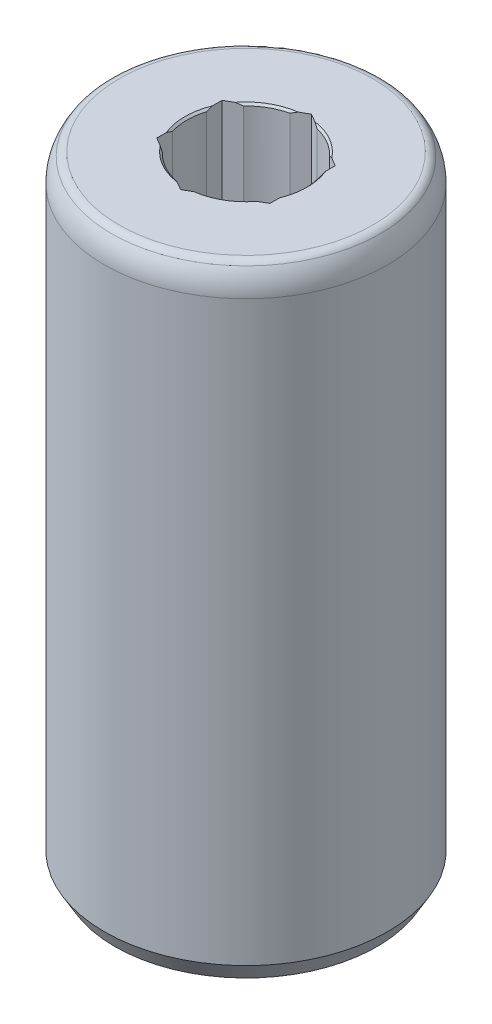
ISO-10303-21;
HEADER;
FILE_DESCRIPTION(('STEP AP214'),'2;1');
FILE_NAME('part.step','',(''),(''),'','','');
FILE_SCHEMA(('AUTOMOTIVE_DESIGN { 1 0 10303 214 1 1 1 1 }'));
ENDSEC;
DATA;
#1=APPLICATION_CONTEXT('core data for automotive mechanical design processes');
#2=APPLICATION_PROTOCOL_DEFINITION('international standard','automotive_design',2000,#1);
#3=PRODUCT_CONTEXT('',#1,'mechanical');
#4=PRODUCT('Part','Part','',(#3));
#5=PRODUCT_RELATED_PRODUCT_CATEGORY('part','',(#4));
#6=PRODUCT_DEFINITION_FORMATION('','',#4);
#7=PRODUCT_DEFINITION_CONTEXT('part definition',#1,'design');
#8=PRODUCT_DEFINITION('design','',#6,#7);
#9=PRODUCT_DEFINITION_SHAPE('','',#8);
#10=(LENGTH_UNIT() NAMED_UNIT(*) SI_UNIT(.MILLI.,.METRE.));
#11=(NAMED_UNIT(*) PLANE_ANGLE_UNIT() SI_UNIT($,.RADIAN.));
#12=(NAMED_UNIT(*) SI_UNIT($,.STERADIAN.) SOLID_ANGLE_UNIT());
#13=UNCERTAINTY_MEASURE_WITH_UNIT(LENGTH_MEASURE(1.E-05),#10,'distance_accuracy_value','');
#14=(GEOMETRIC_REPRESENTATION_CONTEXT(3) GLOBAL_UNCERTAINTY_ASSIGNED_CONTEXT((#13)) GLOBAL_UNIT_ASSIGNED_CONTEXT((#10,
#11,#12)) REPRESENTATION_CONTEXT('',''));
#15=CARTESIAN_POINT('',(0.,0.,0.));
#16=DIRECTION('',(0.,0.,1.));
#17=DIRECTION('',(1.,0.,0.));
#18=AXIS2_PLACEMENT_3D('',#15,#16,#17);
#19=CARTESIAN_POINT('',(0.,-19.05,0.));
#20=DIRECTION('',(0.,-1.,0.));
#21=DIRECTION('',(0.,0.,-1.));
#22=AXIS2_PLACEMENT_3D('',#19,#20,#21);
#23=PLANE('',#22);
#24=CARTESIAN_POINT('',(0.,-19.05,0.));
#25=DIRECTION('',(0.,-1.,0.));
#26=DIRECTION('',(0.,0.,-1.));
#27=AXIS2_PLACEMENT_3D('',#24,#25,#26);
#28=CIRCLE('',#27,2.5527);
#29=CARTESIAN_POINT('',(0.,-19.05,-2.5527));
#30=VERTEX_POINT('',#29);
#31=EDGE_CURVE('E265',#30,#30,#28,.T.);
#32=ORIENTED_EDGE('',*,*,#31,.F.);
#33=EDGE_LOOP('',(#32));
#34=FACE_BOUND('',#33,.T.);
#35=CARTESIAN_POINT('',(0.,-19.05,0.));
#36=DIRECTION('',(0.,-1.,0.));
#37=DIRECTION('',(0.,0.,-1.));
#38=AXIS2_PLACEMENT_3D('',#35,#36,#37);
#39=CIRCLE('',#38,7.35091212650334);
#40=CARTESIAN_POINT('',(0.,-19.05,-7.35091212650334));
#41=VERTEX_POINT('',#40);
#42=EDGE_CURVE('E283',#41,#41,#39,.T.);
#43=ORIENTED_EDGE('',*,*,#42,.T.);
#44=EDGE_LOOP('',(#43));
#45=FACE_BOUND('',#44,.T.);
#46=ADVANCED_FACE('F41',(#34,#45),#23,.T.);
#47=CARTESIAN_POINT('',(0.,-19.05,0.));
#48=DIRECTION('',(0.,1.,0.));
#49=DIRECTION('',(0.,0.,1.));
#50=AXIS2_PLACEMENT_3D('',#47,#48,#49);
#51=CONICAL_SURFACE('',#50,7.35091212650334,0.523598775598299);
#52=CARTESIAN_POINT('',(0.,-18.034,0.));
#53=DIRECTION('',(0.,-1.,0.));
#54=DIRECTION('',(0.,0.,-1.));
#55=AXIS2_PLACEMENT_3D('',#52,#53,#54);
#56=CIRCLE('',#55,7.9375);
#57=CARTESIAN_POINT('',(0.,-18.034,-7.9375));
#58=VERTEX_POINT('',#57);
#59=EDGE_CURVE('E280',#58,#58,#56,.T.);
#60=ORIENTED_EDGE('',*,*,#59,.T.);
#61=EDGE_LOOP('',(#60));
#62=FACE_BOUND('',#61,.T.);
#63=ORIENTED_EDGE('',*,*,#42,.F.);
#64=EDGE_LOOP('',(#63));
#65=FACE_BOUND('',#64,.T.);
#66=ADVANCED_FACE('F456',(#62,#65),#51,.T.);
#67=CARTESIAN_POINT('',(0.,-19.05,0.));
#68=DIRECTION('',(0.,-1.,0.));
#69=DIRECTION('',(0.,0.,-1.));
#70=AXIS2_PLACEMENT_3D('',#67,#68,#69);
#71=CYLINDRICAL_SURFACE('',#70,7.9375);
#72=CARTESIAN_POINT('',(0.,14.351,0.));
#73=DIRECTION('',(0.,-1.,0.));
#74=DIRECTION('',(0.,0.,-1.));
#75=AXIS2_PLACEMENT_3D('',#72,#73,#74);
#76=CIRCLE('',#75,7.9375);
#77=CARTESIAN_POINT('',(0.,14.351,-7.9375));
#78=VERTEX_POINT('',#77);
#79=EDGE_CURVE('E277',#78,#78,#76,.T.);
#80=ORIENTED_EDGE('',*,*,#79,.T.);
#81=EDGE_LOOP('',(#80));
#82=FACE_BOUND('',#81,.T.);
#83=ORIENTED_EDGE('',*,*,#59,.F.);
#84=EDGE_LOOP('',(#83));
#85=FACE_BOUND('',#84,.T.);
#86=ADVANCED_FACE('F461',(#82,#85),#71,.T.);
#87=CARTESIAN_POINT('',(0.,14.351,0.));
#88=DIRECTION('',(0.,-1.,0.));
#89=DIRECTION('',(0.,0.,-1.));
#90=AXIS2_PLACEMENT_3D('',#87,#88,#89);
#91=TOROIDAL_SURFACE('',#90,5.6515,2.286);
#92=CARTESIAN_POINT('',(0.,15.6572857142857,0.));
#93=DIRECTION('',(0.,-1.,0.));
#94=DIRECTION('',(0.,0.,-1.));
#95=AXIS2_PLACEMENT_3D('',#92,#93,#94);
#96=CIRCLE('',#95,7.52751002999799);
#97=CARTESIAN_POINT('',(0.,15.6572857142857,-7.52751002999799));
#98=VERTEX_POINT('',#97);
#99=EDGE_CURVE('E274',#98,#98,#96,.T.);
#100=ORIENTED_EDGE('',*,*,#99,.T.);
#101=EDGE_LOOP('',(#100));
#102=FACE_BOUND('',#101,.T.);
#103=ORIENTED_EDGE('',*,*,#79,.F.);
#104=EDGE_LOOP('',(#103));
#105=FACE_BOUND('',#104,.T.);
#106=ADVANCED_FACE('F490',(#102,#105),#91,.T.);
#107=CARTESIAN_POINT('',(0.,15.367,0.));
#108=DIRECTION('',(0.,-1.,0.));
#109=DIRECTION('',(0.,0.,-1.));
#110=AXIS2_PLACEMENT_3D('',#107,#108,#109);
#111=TOROIDAL_SURFACE('',#110,7.11061891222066,0.507999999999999);
#112=CARTESIAN_POINT('',(0.,15.875,0.));
#113=DIRECTION('',(0.,-1.,0.));
#114=DIRECTION('',(0.,0.,-1.));
#115=AXIS2_PLACEMENT_3D('',#112,#113,#114);
#116=CIRCLE('',#115,7.11061891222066);
#117=CARTESIAN_POINT('',(0.,15.875,-7.11061891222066));
#118=VERTEX_POINT('',#117);
#119=EDGE_CURVE('E271',#118,#118,#116,.T.);
#120=ORIENTED_EDGE('',*,*,#119,.T.);
#121=EDGE_LOOP('',(#120));
#122=FACE_BOUND('',#121,.T.);
#123=ORIENTED_EDGE('',*,*,#99,.F.);
#124=EDGE_LOOP('',(#123));
#125=FACE_BOUND('',#124,.T.);
#126=ADVANCED_FACE('F487',(#122,#125),#111,.T.);
#127=CARTESIAN_POINT('',(7.11061891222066,15.875,0.));
#128=DIRECTION('',(0.,1.,0.));
#129=DIRECTION('',(0.,0.,1.));
#130=AXIS2_PLACEMENT_3D('',#127,#128,#129);
#131=PLANE('',#130);
#132=CARTESIAN_POINT('',(0.,15.875,0.));
#133=DIRECTION('',(0.,-1.,0.));
#134=DIRECTION('',(1.,0.,0.));
#135=AXIS2_PLACEMENT_3D('',#132,#133,#134);
#136=CIRCLE('',#135,3.42900000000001);
#137=CARTESIAN_POINT('',(2.70913363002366,15.875,2.1020551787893));
#138=VERTEX_POINT('',#137);
#139=CARTESIAN_POINT('',(0.465866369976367,15.875,3.39720613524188));
#140=VERTEX_POINT('',#139);
#141=EDGE_CURVE('E61',#138,#140,#136,.T.);
#142=ORIENTED_EDGE('',*,*,#141,.T.);
#143=DIRECTION('',(0.866025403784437,0.,-0.500000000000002));
#144=VECTOR('',#143,1.);
#145=CARTESIAN_POINT('',(0.,15.875,3.66617420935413));
#146=LINE('',#145,#144);
#147=CARTESIAN_POINT('',(0.,15.875,3.66617420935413));
#148=VERTEX_POINT('',#147);
#149=EDGE_CURVE('E241',#148,#140,#146,.T.);
#150=ORIENTED_EDGE('',*,*,#149,.F.);
#151=DIRECTION('',(0.866025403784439,0.,0.499999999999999));
#152=VECTOR('',#151,1.);
#153=CARTESIAN_POINT('',(-3.17499999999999,15.875,1.83308710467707));
#154=LINE('',#153,#152);
#155=CARTESIAN_POINT('',(-0.46586636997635,15.875,3.39720613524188));
#156=VERTEX_POINT('',#155);
#157=EDGE_CURVE('E853',#156,#148,#154,.T.);
#158=ORIENTED_EDGE('',*,*,#157,.F.);
#159=CARTESIAN_POINT('',(-2.70913363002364,15.875,2.10205517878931));
#160=VERTEX_POINT('',#159);
#161=EDGE_CURVE('E856',#156,#160,#136,.T.);
#162=ORIENTED_EDGE('',*,*,#161,.T.);
#163=CARTESIAN_POINT('',(-3.17499999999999,15.875,1.83308710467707));
#164=VERTEX_POINT('',#163);
#165=EDGE_CURVE('E337',#164,#160,#154,.T.);
#166=ORIENTED_EDGE('',*,*,#165,.F.);
#167=DIRECTION('',(0.,0.,1.));
#168=VECTOR('',#167,1.);
#169=CARTESIAN_POINT('',(-3.175,15.875,-1.83308710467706));
#170=LINE('',#169,#168);
#171=CARTESIAN_POINT('',(-3.175,15.875,1.2951509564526));
#172=VERTEX_POINT('',#171);
#173=EDGE_CURVE('E850',#172,#164,#170,.T.);
#174=ORIENTED_EDGE('',*,*,#173,.F.);
#175=CARTESIAN_POINT('',(-3.175,15.875,-1.29515095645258));
#176=VERTEX_POINT('',#175);
#177=EDGE_CURVE('E858',#172,#176,#136,.T.);
#178=ORIENTED_EDGE('',*,*,#177,.T.);
#179=CARTESIAN_POINT('',(-3.175,15.875,-1.83308710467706));
#180=VERTEX_POINT('',#179);
#181=EDGE_CURVE('E851',#180,#176,#170,.T.);
#182=ORIENTED_EDGE('',*,*,#181,.F.);
#183=DIRECTION('',(-0.866025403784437,0.,0.500000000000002));
#184=VECTOR('',#183,1.);
#185=CARTESIAN_POINT('',(0.,15.875,-3.66617420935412));
#186=LINE('',#185,#184);
#187=CARTESIAN_POINT('',(-2.70913363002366,15.875,-2.10205517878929));
#188=VERTEX_POINT('',#187);
#189=EDGE_CURVE('E845',#188,#180,#186,.T.);
#190=ORIENTED_EDGE('',*,*,#189,.F.);
#191=CARTESIAN_POINT('',(-0.465866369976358,15.875,-3.39720613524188));
#192=VERTEX_POINT('',#191);
#193=EDGE_CURVE('E860',#188,#192,#136,.T.);
#194=ORIENTED_EDGE('',*,*,#193,.T.);
#195=CARTESIAN_POINT('',(0.,15.875,-3.66617420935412));
#196=VERTEX_POINT('',#195);
#197=EDGE_CURVE('E847',#196,#192,#186,.T.);
#198=ORIENTED_EDGE('',*,*,#197,.F.);
#199=DIRECTION('',(-0.86602540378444,0.,-0.499999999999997));
#200=VECTOR('',#199,1.);
#201=CARTESIAN_POINT('',(3.175,15.875,-1.83308710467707));
#202=LINE('',#201,#200);
#203=CARTESIAN_POINT('',(0.465866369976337,15.875,-3.39720613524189));
#204=VERTEX_POINT('',#203);
#205=EDGE_CURVE('E846',#204,#196,#202,.T.);
#206=ORIENTED_EDGE('',*,*,#205,.F.);
#207=CARTESIAN_POINT('',(2.70913363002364,15.875,-2.10205517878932));
#208=VERTEX_POINT('',#207);
#209=EDGE_CURVE('E230',#204,#208,#136,.T.);
#210=ORIENTED_EDGE('',*,*,#209,.T.);
#211=CARTESIAN_POINT('',(3.175,15.875,-1.83308710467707));
#212=VERTEX_POINT('',#211);
#213=EDGE_CURVE('E842',#212,#208,#202,.T.);
#214=ORIENTED_EDGE('',*,*,#213,.F.);
#215=DIRECTION('',(0.,0.,-1.));
#216=VECTOR('',#215,1.);
#217=CARTESIAN_POINT('',(3.17500000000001,15.875,1.83308710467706));
#218=LINE('',#217,#216);
#219=CARTESIAN_POINT('',(3.175,15.875,-1.29515095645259));
#220=VERTEX_POINT('',#219);
#221=EDGE_CURVE('E229',#220,#212,#218,.T.);
#222=ORIENTED_EDGE('',*,*,#221,.F.);
#223=CARTESIAN_POINT('',(3.17500000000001,15.875,1.29515095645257));
#224=VERTEX_POINT('',#223);
#225=EDGE_CURVE('E69',#220,#224,#136,.T.);
#226=ORIENTED_EDGE('',*,*,#225,.T.);
#227=CARTESIAN_POINT('',(3.17500000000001,15.875,1.83308710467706));
#228=VERTEX_POINT('',#227);
#229=EDGE_CURVE('E227',#228,#224,#218,.T.);
#230=ORIENTED_EDGE('',*,*,#229,.F.);
#231=EDGE_CURVE('E854',#138,#228,#146,.T.);
#232=ORIENTED_EDGE('',*,*,#231,.F.);
#233=EDGE_LOOP('',(#142,#150,#158,#162,#166,#174,#178,#182,#190,#194,#198,#206,#210,#214,#222,
#226,#230,#232));
#234=FACE_BOUND('',#233,.T.);
#235=ORIENTED_EDGE('',*,*,#119,.F.);
#236=EDGE_LOOP('',(#235));
#237=FACE_BOUND('',#236,.T.);
#238=ADVANCED_FACE('F224',(#234,#237),#131,.T.);
#239=CARTESIAN_POINT('',(0.,-6.858,0.));
#240=DIRECTION('',(0.,-1.,0.));
#241=DIRECTION('',(0.,0.,-1.));
#242=AXIS2_PLACEMENT_3D('',#239,#240,#241);
#243=CONICAL_SURFACE('',#242,2.5527,1.02974425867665);
#244=CARTESIAN_POINT('',(0.,-5.32418309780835,0.));
#245=VERTEX_POINT('',#244);
#246=VERTEX_LOOP('',#245);
#247=FACE_BOUND('',#246,.T.);
#248=CARTESIAN_POINT('',(0.,-6.858,0.));
#249=DIRECTION('',(0.,-1.,0.));
#250=DIRECTION('',(0.,0.,-1.));
#251=AXIS2_PLACEMENT_3D('',#248,#249,#250);
#252=CIRCLE('',#251,2.5527);
#253=CARTESIAN_POINT('',(0.,-6.858,-2.5527));
#254=VERTEX_POINT('',#253);
#255=EDGE_CURVE('E268',#254,#254,#252,.T.);
#256=ORIENTED_EDGE('',*,*,#255,.T.);
#257=EDGE_LOOP('',(#256));
#258=FACE_BOUND('',#257,.T.);
#259=ADVANCED_FACE('F471',(#247,#258),#243,.F.);
#260=CARTESIAN_POINT('',(0.,-19.05,0.));
#261=DIRECTION('',(0.,-1.,0.));
#262=DIRECTION('',(0.,0.,-1.));
#263=AXIS2_PLACEMENT_3D('',#260,#261,#262);
#264=CYLINDRICAL_SURFACE('',#263,2.5527);
#265=ORIENTED_EDGE('',*,*,#255,.F.);
#266=EDGE_LOOP('',(#265));
#267=FACE_BOUND('',#266,.T.);
#268=ORIENTED_EDGE('',*,*,#31,.T.);
#269=EDGE_LOOP('',(#268));
#270=FACE_BOUND('',#269,.T.);
#271=ADVANCED_FACE('F468',(#267,#270),#264,.F.);
#272=CARTESIAN_POINT('',(0.,9.525,0.));
#273=DIRECTION('',(0.,1.,0.));
#274=DIRECTION('',(0.,0.,1.));
#275=AXIS2_PLACEMENT_3D('',#272,#273,#274);
#276=CONICAL_SURFACE('',#275,3.3147,1.02974425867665);
#277=CARTESIAN_POINT('',(0.,7.53332730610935,0.));
#278=VERTEX_POINT('',#277);
#279=VERTEX_LOOP('',#278);
#280=FACE_BOUND('',#279,.T.);
#281=CARTESIAN_POINT('',(0.,9.525,0.));
#282=DIRECTION('',(0.,1.,0.));
#283=DIRECTION('',(0.,0.,1.));
#284=AXIS2_PLACEMENT_3D('',#281,#282,#283);
#285=CIRCLE('',#284,3.3147);
#286=CARTESIAN_POINT('',(0.,9.525,3.3147));
#287=VERTEX_POINT('',#286);
#288=EDGE_CURVE('E248',#287,#287,#285,.T.);
#289=ORIENTED_EDGE('',*,*,#288,.T.);
#290=EDGE_LOOP('',(#289));
#291=FACE_BOUND('',#290,.T.);
#292=ADVANCED_FACE('F470',(#280,#291),#276,.F.);
#293=CARTESIAN_POINT('',(0.,15.875,0.));
#294=DIRECTION('',(0.,1.,0.));
#295=DIRECTION('',(0.,0.,1.));
#296=AXIS2_PLACEMENT_3D('',#293,#294,#295);
#297=CYLINDRICAL_SURFACE('',#296,3.3147);
#298=DIRECTION('',(0.,1.,0.));
#299=VECTOR('',#298,1.);
#300=CARTESIAN_POINT('',(-2.41209585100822,15.875,2.27355002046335));
#301=LINE('',#300,#299);
#302=CARTESIAN_POINT('',(-2.41209585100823,10.287,2.27355002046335));
#303=VERTEX_POINT('',#302);
#304=CARTESIAN_POINT('',(-2.41209585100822,15.7607,2.27355002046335));
#305=VERTEX_POINT('',#304);
#306=EDGE_CURVE('E54',#303,#305,#301,.T.);
#307=ORIENTED_EDGE('',*,*,#306,.T.);
#308=CARTESIAN_POINT('',(0.,15.7607,0.));
#309=DIRECTION('',(0.,1.,0.));
#310=DIRECTION('',(-1.,0.,0.));
#311=AXIS2_PLACEMENT_3D('',#308,#309,#310);
#312=CIRCLE('',#311,3.3147);
#313=CARTESIAN_POINT('',(-0.762904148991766,15.7607,3.22571129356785));
#314=VERTEX_POINT('',#313);
#315=EDGE_CURVE('E326',#305,#314,#312,.T.);
#316=ORIENTED_EDGE('',*,*,#315,.T.);
#317=DIRECTION('',(0.,1.,0.));
#318=VECTOR('',#317,1.);
#319=CARTESIAN_POINT('',(-0.762904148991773,15.875,3.22571129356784));
#320=LINE('',#319,#318);
#321=CARTESIAN_POINT('',(-0.762904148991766,10.287,3.22571129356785));
#322=VERTEX_POINT('',#321);
#323=EDGE_CURVE('E289',#314,#322,#320,.F.);
#324=ORIENTED_EDGE('',*,*,#323,.T.);
#325=CARTESIAN_POINT('',(0.,10.287,0.));
#326=DIRECTION('',(0.,1.,0.));
#327=DIRECTION('',(0.,0.,1.));
#328=AXIS2_PLACEMENT_3D('',#325,#326,#327);
#329=CIRCLE('',#328,3.3147);
#330=CARTESIAN_POINT('',(0.762904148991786,10.287,3.22571129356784));
#331=VERTEX_POINT('',#330);
#332=EDGE_CURVE('E286',#331,#322,#329,.F.);
#333=ORIENTED_EDGE('',*,*,#332,.F.);
#334=DIRECTION('',(0.,1.,0.));
#335=VECTOR('',#334,1.);
#336=CARTESIAN_POINT('',(0.762904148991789,15.875,3.22571129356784));
#337=LINE('',#336,#335);
#338=CARTESIAN_POINT('',(0.762904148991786,15.7607,3.22571129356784));
#339=VERTEX_POINT('',#338);
#340=EDGE_CURVE('E293',#331,#339,#337,.T.);
#341=ORIENTED_EDGE('',*,*,#340,.T.);
#342=CARTESIAN_POINT('',(2.41209585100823,15.7607,2.27355002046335));
#343=VERTEX_POINT('',#342);
#344=EDGE_CURVE('E425',#339,#343,#312,.T.);
#345=ORIENTED_EDGE('',*,*,#344,.T.);
#346=DIRECTION('',(0.,1.,0.));
#347=VECTOR('',#346,1.);
#348=CARTESIAN_POINT('',(2.41209585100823,15.875,2.27355002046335));
#349=LINE('',#348,#347);
#350=CARTESIAN_POINT('',(2.41209585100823,10.287,2.27355002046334));
#351=VERTEX_POINT('',#350);
#352=EDGE_CURVE('E296',#343,#351,#349,.F.);
#353=ORIENTED_EDGE('',*,*,#352,.T.);
#354=CARTESIAN_POINT('',(3.17500000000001,10.287,0.952161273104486));
#355=VERTEX_POINT('',#354);
#356=EDGE_CURVE('E291',#355,#351,#329,.F.);
#357=ORIENTED_EDGE('',*,*,#356,.F.);
#358=DIRECTION('',(0.,1.,0.));
#359=VECTOR('',#358,1.);
#360=CARTESIAN_POINT('',(3.17500000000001,15.875,0.952161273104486));
#361=LINE('',#360,#359);
#362=CARTESIAN_POINT('',(3.17500000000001,15.7607,0.952161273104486));
#363=VERTEX_POINT('',#362);
#364=EDGE_CURVE('E298',#355,#363,#361,.T.);
#365=ORIENTED_EDGE('',*,*,#364,.T.);
#366=CARTESIAN_POINT('',(3.175,15.7607,-0.952161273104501));
#367=VERTEX_POINT('',#366);
#368=EDGE_CURVE('E214',#363,#367,#312,.T.);
#369=ORIENTED_EDGE('',*,*,#368,.T.);
#370=DIRECTION('',(0.,1.,0.));
#371=VECTOR('',#370,1.);
#372=CARTESIAN_POINT('',(3.175,15.875,-0.952161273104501));
#373=LINE('',#372,#371);
#374=CARTESIAN_POINT('',(3.175,10.287,-0.952161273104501));
#375=VERTEX_POINT('',#374);
#376=EDGE_CURVE('E301',#367,#375,#373,.F.);
#377=ORIENTED_EDGE('',*,*,#376,.T.);
#378=CARTESIAN_POINT('',(2.41209585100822,10.287,-2.27355002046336));
#379=VERTEX_POINT('',#378);
#380=EDGE_CURVE('E300',#379,#375,#329,.F.);
#381=ORIENTED_EDGE('',*,*,#380,.F.);
#382=DIRECTION('',(0.,1.,0.));
#383=VECTOR('',#382,1.);
#384=CARTESIAN_POINT('',(2.41209585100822,15.875,-2.27355002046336));
#385=LINE('',#384,#383);
#386=CARTESIAN_POINT('',(2.41209585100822,15.7607,-2.27355002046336));
#387=VERTEX_POINT('',#386);
#388=EDGE_CURVE('E303',#379,#387,#385,.T.);
#389=ORIENTED_EDGE('',*,*,#388,.T.);
#390=CARTESIAN_POINT('',(0.762904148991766,15.7607,-3.22571129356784));
#391=VERTEX_POINT('',#390);
#392=EDGE_CURVE('E874',#387,#391,#312,.T.);
#393=ORIENTED_EDGE('',*,*,#392,.T.);
#394=DIRECTION('',(0.,1.,0.));
#395=VECTOR('',#394,1.);
#396=CARTESIAN_POINT('',(0.762904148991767,15.875,-3.22571129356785));
#397=LINE('',#396,#395);
#398=CARTESIAN_POINT('',(0.762904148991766,10.287,-3.22571129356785));
#399=VERTEX_POINT('',#398);
#400=EDGE_CURVE('E310',#391,#399,#397,.F.);
#401=ORIENTED_EDGE('',*,*,#400,.T.);
#402=CARTESIAN_POINT('',(-0.762904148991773,10.287,-3.22571129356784));
#403=VERTEX_POINT('',#402);
#404=EDGE_CURVE('E306',#403,#399,#329,.F.);
#405=ORIENTED_EDGE('',*,*,#404,.F.);
#406=DIRECTION('',(0.,1.,0.));
#407=VECTOR('',#406,1.);
#408=CARTESIAN_POINT('',(-0.762904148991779,15.875,-3.22571129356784));
#409=LINE('',#408,#407);
#410=CARTESIAN_POINT('',(-0.762904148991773,15.7607,-3.22571129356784));
#411=VERTEX_POINT('',#410);
#412=EDGE_CURVE('E307',#403,#411,#409,.T.);
#413=ORIENTED_EDGE('',*,*,#412,.T.);
#414=CARTESIAN_POINT('',(-2.41209585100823,15.7607,-2.27355002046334));
#415=VERTEX_POINT('',#414);
#416=EDGE_CURVE('E345',#411,#415,#312,.T.);
#417=ORIENTED_EDGE('',*,*,#416,.T.);
#418=DIRECTION('',(0.,1.,0.));
#419=VECTOR('',#418,1.);
#420=CARTESIAN_POINT('',(-2.41209585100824,15.875,-2.27355002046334));
#421=LINE('',#420,#419);
#422=CARTESIAN_POINT('',(-2.41209585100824,10.287,-2.27355002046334));
#423=VERTEX_POINT('',#422);
#424=EDGE_CURVE('E313',#415,#423,#421,.F.);
#425=ORIENTED_EDGE('',*,*,#424,.T.);
#426=CARTESIAN_POINT('',(-3.175,10.287,-0.9521612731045));
#427=VERTEX_POINT('',#426);
#428=EDGE_CURVE('E312',#427,#423,#329,.F.);
#429=ORIENTED_EDGE('',*,*,#428,.F.);
#430=DIRECTION('',(0.,1.,0.));
#431=VECTOR('',#430,1.);
#432=CARTESIAN_POINT('',(-3.175,15.875,-0.9521612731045));
#433=LINE('',#432,#431);
#434=CARTESIAN_POINT('',(-3.175,15.7607,-0.9521612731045));
#435=VERTEX_POINT('',#434);
#436=EDGE_CURVE('E315',#427,#435,#433,.T.);
#437=ORIENTED_EDGE('',*,*,#436,.T.);
#438=CARTESIAN_POINT('',(-3.175,15.7607,0.952161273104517));
#439=VERTEX_POINT('',#438);
#440=EDGE_CURVE('E344',#435,#439,#312,.T.);
#441=ORIENTED_EDGE('',*,*,#440,.T.);
#442=DIRECTION('',(0.,1.,0.));
#443=VECTOR('',#442,1.);
#444=CARTESIAN_POINT('',(-3.175,15.875,0.952161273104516));
#445=LINE('',#444,#443);
#446=CARTESIAN_POINT('',(-3.175,10.287,0.952161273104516));
#447=VERTEX_POINT('',#446);
#448=EDGE_CURVE('E318',#439,#447,#445,.F.);
#449=ORIENTED_EDGE('',*,*,#448,.T.);
#450=EDGE_CURVE('E290',#303,#447,#329,.F.);
#451=ORIENTED_EDGE('',*,*,#450,.F.);
#452=EDGE_LOOP('',(#307,#316,#324,#333,#341,#345,#353,#357,#365,#369,#377,#381,#389,#393,#401,
#405,#413,#417,#425,#429,#437,#441,#449,#451));
#453=FACE_BOUND('',#452,.T.);
#454=ORIENTED_EDGE('',*,*,#288,.F.);
#455=EDGE_LOOP('',(#454));
#456=FACE_BOUND('',#455,.T.);
#457=ADVANCED_FACE('F324',(#453,#456),#297,.F.);
#458=CARTESIAN_POINT('',(0.,10.287,0.));
#459=DIRECTION('',(0.,1.,0.));
#460=DIRECTION('',(0.,0.,1.));
#461=AXIS2_PLACEMENT_3D('',#458,#459,#460);
#462=PLANE('',#461);
#463=ORIENTED_EDGE('',*,*,#332,.T.);
#464=DIRECTION('',(0.866025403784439,0.,0.499999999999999));
#465=VECTOR('',#464,1.);
#466=CARTESIAN_POINT('',(-3.17499999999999,10.287,1.83308710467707));
#467=LINE('',#466,#465);
#468=CARTESIAN_POINT('',(0.,10.287,3.66617420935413));
#469=VERTEX_POINT('',#468);
#470=EDGE_CURVE('E823',#322,#469,#467,.T.);
#471=ORIENTED_EDGE('',*,*,#470,.T.);
#472=DIRECTION('',(0.866025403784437,0.,-0.500000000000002));
#473=VECTOR('',#472,1.);
#474=CARTESIAN_POINT('',(0.,10.287,3.66617420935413));
#475=LINE('',#474,#473);
#476=EDGE_CURVE('E826',#469,#331,#475,.T.);
#477=ORIENTED_EDGE('',*,*,#476,.T.);
#478=EDGE_LOOP('',(#463,#471,#477));
#479=FACE_BOUND('',#478,.T.);
#480=ADVANCED_FACE('F548',(#479),#462,.T.);
#481=CARTESIAN_POINT('',(-3.17499999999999,10.287,1.83308710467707));
#482=DIRECTION('',(-0.499999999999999,0.,0.866025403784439));
#483=DIRECTION('',(0.866025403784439,0.,0.499999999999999));
#484=AXIS2_PLACEMENT_3D('',#481,#482,#483);
#485=PLANE('',#484);
#486=ORIENTED_EDGE('',*,*,#323,.F.);
#487=CARTESIAN_POINT('',(-0.763104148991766,15.760633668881,3.22559582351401));
#488=CARTESIAN_POINT('',(-0.737957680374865,15.7689726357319,3.24011414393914));
#489=CARTESIAN_POINT('',(-0.71289221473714,15.7776349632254,3.25458569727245));
#490=CARTESIAN_POINT('',(-0.662937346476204,15.795571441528,3.28342715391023));
#491=CARTESIAN_POINT('',(-0.63804787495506,15.8048453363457,3.29779709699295));
#492=CARTESIAN_POINT('',(-0.588438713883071,15.8239768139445,3.32643895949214));
#493=CARTESIAN_POINT('',(-0.563719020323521,15.833834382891,3.34071088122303));
#494=CARTESIAN_POINT('',(-0.514440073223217,15.8541072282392,3.36916209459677));
#495=CARTESIAN_POINT('',(-0.489880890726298,15.8645227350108,3.38334134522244));
#496=CARTESIAN_POINT('',(-0.465407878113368,15.8752,3.3974708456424));
#497=B_SPLINE_CURVE_WITH_KNOTS('',3,(#487,#488,#489,#490,#491,#492,#493,#494,#495,#496),
.UNSPECIFIED.,.F.,.F.,(4,2,2,2,4),(0.,0.0906282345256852,0.181218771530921,0.271807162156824,
0.362433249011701),.UNSPECIFIED.);
#498=EDGE_CURVE('E342',#314,#156,#497,.T.);
#499=ORIENTED_EDGE('',*,*,#498,.T.);
#500=ORIENTED_EDGE('',*,*,#157,.T.);
#501=DIRECTION('',(0.,1.,0.));
#502=VECTOR('',#501,1.);
#503=CARTESIAN_POINT('',(0.,10.287,3.66617420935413));
#504=LINE('',#503,#502);
#505=EDGE_CURVE('E250',#469,#148,#504,.T.);
#506=ORIENTED_EDGE('',*,*,#505,.F.);
#507=ORIENTED_EDGE('',*,*,#470,.F.);
#508=EDGE_LOOP('',(#486,#499,#500,#506,#507));
#509=FACE_BOUND('',#508,.T.);
#510=ADVANCED_FACE('F363',(#509),#485,.F.);
#511=CARTESIAN_POINT('',(0.,10.287,3.66617420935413));
#512=DIRECTION('',(0.500000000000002,0.,0.866025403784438));
#513=DIRECTION('',(0.866025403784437,0.,-0.500000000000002));
#514=AXIS2_PLACEMENT_3D('',#511,#512,#513);
#515=PLANE('',#514);
#516=ORIENTED_EDGE('',*,*,#149,.T.);
#517=CARTESIAN_POINT('',(0.465407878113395,15.8752,3.39747084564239));
#518=CARTESIAN_POINT('',(0.48988089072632,15.8645227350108,3.38334134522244));
#519=CARTESIAN_POINT('',(0.514440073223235,15.8541072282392,3.36916209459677));
#520=CARTESIAN_POINT('',(0.563719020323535,15.833834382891,3.34071088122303));
#521=CARTESIAN_POINT('',(0.588438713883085,15.8239768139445,3.32643895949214));
#522=CARTESIAN_POINT('',(0.638047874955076,15.8048453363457,3.29779709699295));
#523=CARTESIAN_POINT('',(0.662937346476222,15.795571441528,3.28342715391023));
#524=CARTESIAN_POINT('',(0.712892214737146,15.7776349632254,3.25458569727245));
#525=CARTESIAN_POINT('',(0.737957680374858,15.7689726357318,3.24011414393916));
#526=CARTESIAN_POINT('',(0.763104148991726,15.7606336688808,3.22559582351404));
#527=B_SPLINE_CURVE_WITH_KNOTS('',3,(#517,#518,#519,#520,#521,#522,#523,#524,#525,#526),
.UNSPECIFIED.,.F.,.F.,(4,2,2,2,4),(0.,0.0906260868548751,0.181214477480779,0.271805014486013,
0.362433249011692),.UNSPECIFIED.);
#528=EDGE_CURVE('E426',#140,#339,#527,.T.);
#529=ORIENTED_EDGE('',*,*,#528,.T.);
#530=ORIENTED_EDGE('',*,*,#340,.F.);
#531=ORIENTED_EDGE('',*,*,#476,.F.);
#532=ORIENTED_EDGE('',*,*,#505,.T.);
#533=EDGE_LOOP('',(#516,#529,#530,#531,#532));
#534=FACE_BOUND('',#533,.T.);
#535=ADVANCED_FACE('F436',(#534),#515,.F.);
#536=ORIENTED_EDGE('',*,*,#356,.T.);
#537=CARTESIAN_POINT('',(3.17500000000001,10.287,1.83308710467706));
#538=VERTEX_POINT('',#537);
#539=EDGE_CURVE('E829',#351,#538,#475,.T.);
#540=ORIENTED_EDGE('',*,*,#539,.T.);
#541=DIRECTION('',(0.,0.,-1.));
#542=VECTOR('',#541,1.);
#543=CARTESIAN_POINT('',(3.17500000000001,10.287,1.83308710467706));
#544=LINE('',#543,#542);
#545=EDGE_CURVE('E262',#538,#355,#544,.T.);
#546=ORIENTED_EDGE('',*,*,#545,.T.);
#547=EDGE_LOOP('',(#536,#540,#546));
#548=FACE_BOUND('',#547,.T.);
#549=ADVANCED_FACE('F434',(#548),#462,.T.);
#550=ORIENTED_EDGE('',*,*,#352,.F.);
#551=CARTESIAN_POINT('',(2.41189585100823,15.760633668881,2.27366549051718));
#552=CARTESIAN_POINT('',(2.43704231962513,15.7689726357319,2.25914717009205));
#553=CARTESIAN_POINT('',(2.46210778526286,15.7776349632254,2.24467561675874));
#554=CARTESIAN_POINT('',(2.51206265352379,15.795571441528,2.21583416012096));
#555=CARTESIAN_POINT('',(2.53695212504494,15.8048453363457,2.20146421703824));
#556=CARTESIAN_POINT('',(2.58656128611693,15.8239768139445,2.17282235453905));
#557=CARTESIAN_POINT('',(2.61128097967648,15.833834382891,2.15855043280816));
#558=CARTESIAN_POINT('',(2.66055992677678,15.8541072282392,2.13009921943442));
#559=CARTESIAN_POINT('',(2.6851191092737,15.8645227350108,2.11591996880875));
#560=CARTESIAN_POINT('',(2.70959212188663,15.8752,2.10179046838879));
#561=B_SPLINE_CURVE_WITH_KNOTS('',3,(#551,#552,#553,#554,#555,#556,#557,#558,#559,#560),
.UNSPECIFIED.,.F.,.F.,(4,2,2,2,4),(0.,0.0906282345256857,0.181218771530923,0.271807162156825,
0.362433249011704),.UNSPECIFIED.);
#562=EDGE_CURVE('E219',#343,#138,#561,.T.);
#563=ORIENTED_EDGE('',*,*,#562,.T.);
#564=ORIENTED_EDGE('',*,*,#231,.T.);
#565=DIRECTION('',(0.,1.,0.));
#566=VECTOR('',#565,1.);
#567=CARTESIAN_POINT('',(3.17500000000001,10.287,1.83308710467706));
#568=LINE('',#567,#566);
#569=EDGE_CURVE('E236',#538,#228,#568,.T.);
#570=ORIENTED_EDGE('',*,*,#569,.F.);
#571=ORIENTED_EDGE('',*,*,#539,.F.);
#572=EDGE_LOOP('',(#550,#563,#564,#570,#571));
#573=FACE_BOUND('',#572,.T.);
#574=ADVANCED_FACE('F431',(#573),#515,.F.);
#575=CARTESIAN_POINT('',(3.17500000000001,10.287,1.83308710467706));
#576=DIRECTION('',(1.,0.,0.));
#577=DIRECTION('',(0.,0.,-1.));
#578=AXIS2_PLACEMENT_3D('',#575,#576,#577);
#579=PLANE('',#578);
#580=ORIENTED_EDGE('',*,*,#229,.T.);
#581=CARTESIAN_POINT('',(3.17500000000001,16.5786223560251,2.64536245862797));
#582=CARTESIAN_POINT('',(3.17500000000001,16.5380732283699,2.58200884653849));
#583=CARTESIAN_POINT('',(3.17500000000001,16.4981275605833,2.51827000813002));
#584=CARTESIAN_POINT('',(3.17500000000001,16.4196314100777,2.38991774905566));
#585=CARTESIAN_POINT('',(3.17500000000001,16.3810812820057,2.32530411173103));
#586=CARTESIAN_POINT('',(3.17500000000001,16.267539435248,2.12952976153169));
#587=CARTESIAN_POINT('',(3.17500000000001,16.1949792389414,1.99693385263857));
#588=CARTESIAN_POINT('',(3.17500000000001,16.0604319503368,1.73097902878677));
#589=CARTESIAN_POINT('',(3.17500000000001,15.9982101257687,1.59773996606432));
#590=CARTESIAN_POINT('',(3.17500000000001,15.8848663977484,1.32675162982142));
#591=CARTESIAN_POINT('',(3.17500000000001,15.8337265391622,1.18901007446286));
#592=CARTESIAN_POINT('',(3.17500000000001,15.7652617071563,0.970766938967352));
#593=CARTESIAN_POINT('',(3.17500000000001,15.7429712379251,0.891817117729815));
#594=CARTESIAN_POINT('',(3.17500000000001,15.7035216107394,0.732644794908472));
#595=CARTESIAN_POINT('',(3.17500000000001,15.6863615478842,0.652422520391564));
#596=CARTESIAN_POINT('',(3.17500000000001,15.6575456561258,0.489771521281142));
#597=CARTESIAN_POINT('',(3.175,15.6459740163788,0.407327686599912));
#598=CARTESIAN_POINT('',(3.175,15.6291088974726,0.241708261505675));
#599=CARTESIAN_POINT('',(3.175,15.6238227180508,0.158531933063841));
#600=CARTESIAN_POINT('',(3.175,15.6218915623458,0.0752476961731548));
#601=B_SPLINE_CURVE_WITH_KNOTS('',3,(#581,#582,#583,#584,#585,#586,#587,#588,#589,#590,#591,
#592,#593,#594,#595,#596,#597,#598,#599,#600),.UNSPECIFIED.,.F.,.F.,(4,2,2,2,2,2,2,2,2,4),(0.,
0.225649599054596,0.451356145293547,0.904548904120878,1.3453581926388,1.78544784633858,
2.0314136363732,2.27733601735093,2.52685580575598,2.776665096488),.UNSPECIFIED.);
#602=EDGE_CURVE('E211',#224,#363,#601,.T.);
#603=ORIENTED_EDGE('',*,*,#602,.T.);
#604=ORIENTED_EDGE('',*,*,#364,.F.);
#605=ORIENTED_EDGE('',*,*,#545,.F.);
#606=ORIENTED_EDGE('',*,*,#569,.T.);
#607=EDGE_LOOP('',(#580,#603,#604,#605,#606));
#608=FACE_BOUND('',#607,.T.);
#609=ADVANCED_FACE('F233',(#608),#579,.F.);
#610=ORIENTED_EDGE('',*,*,#380,.T.);
#611=CARTESIAN_POINT('',(3.175,10.287,-1.83308710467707));
#612=VERTEX_POINT('',#611);
#613=EDGE_CURVE('E828',#375,#612,#544,.T.);
#614=ORIENTED_EDGE('',*,*,#613,.T.);
#615=DIRECTION('',(-0.86602540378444,0.,-0.499999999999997));
#616=VECTOR('',#615,1.);
#617=CARTESIAN_POINT('',(3.175,10.287,-1.83308710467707));
#618=LINE('',#617,#616);
#619=EDGE_CURVE('E239',#612,#379,#618,.T.);
#620=ORIENTED_EDGE('',*,*,#619,.T.);
#621=EDGE_LOOP('',(#610,#614,#620));
#622=FACE_BOUND('',#621,.T.);
#623=ADVANCED_FACE('F442',(#622),#462,.T.);
#624=ORIENTED_EDGE('',*,*,#376,.F.);
#625=CARTESIAN_POINT('',(3.175,15.6210008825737,0.00236734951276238));
#626=CARTESIAN_POINT('',(3.175,15.6209550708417,-0.0512847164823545));
#627=CARTESIAN_POINT('',(3.175,15.6222815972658,-0.104928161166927));
#628=CARTESIAN_POINT('',(3.175,15.6276258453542,-0.212068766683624));
#629=CARTESIAN_POINT('',(3.175,15.6316429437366,-0.265565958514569));
#630=CARTESIAN_POINT('',(3.175,15.6476202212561,-0.425375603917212));
#631=CARTESIAN_POINT('',(3.175,15.6635067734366,-0.531315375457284));
#632=CARTESIAN_POINT('',(3.175,15.7043821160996,-0.739369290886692));
#633=CARTESIAN_POINT('',(3.175,15.7292000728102,-0.841517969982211));
#634=CARTESIAN_POINT('',(3.175,15.7867112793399,-1.04360845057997));
#635=CARTESIAN_POINT('',(3.175,15.8194091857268,-1.14354890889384));
#636=CARTESIAN_POINT('',(3.175,15.9054806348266,-1.37978184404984));
#637=CARTESIAN_POINT('',(3.175,15.9619320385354,-1.5149459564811));
#638=CARTESIAN_POINT('',(3.175,16.0844466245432,-1.78090508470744));
#639=CARTESIAN_POINT('',(3.175,16.1505188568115,-1.91169584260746));
#640=CARTESIAN_POINT('',(3.175,16.2917639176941,-2.17294356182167));
#641=CARTESIAN_POINT('',(3.175,16.3671383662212,-2.30329060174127));
#642=CARTESIAN_POINT('',(3.175,16.4843309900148,-2.49601108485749));
#643=CARTESIAN_POINT('',(3.175,16.5240243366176,-2.55969600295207));
#644=CARTESIAN_POINT('',(3.175,16.6046393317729,-2.68626705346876));
#645=CARTESIAN_POINT('',(3.175,16.645560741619,-2.74915333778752));
#646=CARTESIAN_POINT('',(3.175,16.6870151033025,-2.81168705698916));
#647=B_SPLINE_CURVE_WITH_KNOTS('',3,(#625,#626,#627,#628,#629,#630,#631,#632,#633,#634,#635,
#636,#637,#638,#639,#640,#641,#642,#643,#644,#645,#646),.UNSPECIFIED.,.F.,.F.,(4,2,2,2,2,2,2,2,
2,2,4),(0.,0.160920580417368,0.32180389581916,0.642646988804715,0.957653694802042,
1.27284700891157,1.711754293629,2.15107714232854,2.60258781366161,2.82770394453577,
3.05277659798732),.UNSPECIFIED.);
#648=EDGE_CURVE('E411',#367,#220,#647,.T.);
#649=ORIENTED_EDGE('',*,*,#648,.T.);
#650=ORIENTED_EDGE('',*,*,#221,.T.);
#651=DIRECTION('',(0.,1.,0.));
#652=VECTOR('',#651,1.);
#653=CARTESIAN_POINT('',(3.175,10.287,-1.83308710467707));
#654=LINE('',#653,#652);
#655=EDGE_CURVE('E245',#612,#212,#654,.T.);
#656=ORIENTED_EDGE('',*,*,#655,.F.);
#657=ORIENTED_EDGE('',*,*,#613,.F.);
#658=EDGE_LOOP('',(#624,#649,#650,#656,#657));
#659=FACE_BOUND('',#658,.T.);
#660=ADVANCED_FACE('F437',(#659),#579,.F.);
#661=CARTESIAN_POINT('',(3.175,10.287,-1.83308710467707));
#662=DIRECTION('',(0.499999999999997,0.,-0.86602540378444));
#663=DIRECTION('',(-0.86602540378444,0.,-0.499999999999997));
#664=AXIS2_PLACEMENT_3D('',#661,#662,#663);
#665=PLANE('',#664);
#666=ORIENTED_EDGE('',*,*,#213,.T.);
#667=CARTESIAN_POINT('',(2.70959212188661,15.8752,-2.10179046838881));
#668=CARTESIAN_POINT('',(2.68511910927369,15.8645227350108,-2.11591996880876));
#669=CARTESIAN_POINT('',(2.66055992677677,15.8541072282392,-2.13009921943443));
#670=CARTESIAN_POINT('',(2.61128097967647,15.833834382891,-2.15855043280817));
#671=CARTESIAN_POINT('',(2.58656128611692,15.8239768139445,-2.17282235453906));
#672=CARTESIAN_POINT('',(2.53695212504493,15.8048453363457,-2.20146421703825));
#673=CARTESIAN_POINT('',(2.51206265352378,15.795571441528,-2.21583416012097));
#674=CARTESIAN_POINT('',(2.46210778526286,15.7776349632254,-2.24467561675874));
#675=CARTESIAN_POINT('',(2.43704231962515,15.7689726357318,-2.25914717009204));
#676=CARTESIAN_POINT('',(2.41189585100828,15.7606336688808,-2.27366549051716));
#677=B_SPLINE_CURVE_WITH_KNOTS('',3,(#667,#668,#669,#670,#671,#672,#673,#674,#675,#676),
.UNSPECIFIED.,.F.,.F.,(4,2,2,2,4),(0.,0.090626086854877,0.181214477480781,0.271805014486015,
0.362433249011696),.UNSPECIFIED.);
#678=EDGE_CURVE('E404',#208,#387,#677,.T.);
#679=ORIENTED_EDGE('',*,*,#678,.T.);
#680=ORIENTED_EDGE('',*,*,#388,.F.);
#681=ORIENTED_EDGE('',*,*,#619,.F.);
#682=ORIENTED_EDGE('',*,*,#655,.T.);
#683=EDGE_LOOP('',(#666,#679,#680,#681,#682));
#684=FACE_BOUND('',#683,.T.);
#685=ADVANCED_FACE('F441',(#684),#665,.F.);
#686=ORIENTED_EDGE('',*,*,#404,.T.);
#687=CARTESIAN_POINT('',(0.,10.287,-3.66617420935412));
#688=VERTEX_POINT('',#687);
#689=EDGE_CURVE('E237',#399,#688,#618,.T.);
#690=ORIENTED_EDGE('',*,*,#689,.T.);
#691=DIRECTION('',(-0.866025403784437,0.,0.500000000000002));
#692=VECTOR('',#691,1.);
#693=CARTESIAN_POINT('',(0.,10.287,-3.66617420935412));
#694=LINE('',#693,#692);
#695=EDGE_CURVE('E888',#688,#403,#694,.T.);
#696=ORIENTED_EDGE('',*,*,#695,.T.);
#697=EDGE_LOOP('',(#686,#690,#696));
#698=FACE_BOUND('',#697,.T.);
#699=ADVANCED_FACE('F449',(#698),#462,.T.);
#700=CARTESIAN_POINT('',(0.,10.287,-3.66617420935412));
#701=DIRECTION('',(-0.500000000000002,0.,-0.866025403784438));
#702=DIRECTION('',(-0.866025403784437,0.,0.500000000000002));
#703=AXIS2_PLACEMENT_3D('',#700,#701,#702);
#704=PLANE('',#703);
#705=ORIENTED_EDGE('',*,*,#197,.T.);
#706=CARTESIAN_POINT('',(-0.465407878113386,15.8752,-3.39747084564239));
#707=CARTESIAN_POINT('',(-0.48988089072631,15.8645227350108,-3.38334134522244));
#708=CARTESIAN_POINT('',(-0.514440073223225,15.8541072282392,-3.36916209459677));
#709=CARTESIAN_POINT('',(-0.563719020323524,15.833834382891,-3.34071088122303));
#710=CARTESIAN_POINT('',(-0.588438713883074,15.8239768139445,-3.32643895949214));
#711=CARTESIAN_POINT('',(-0.638047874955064,15.8048453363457,-3.29779709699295));
#712=CARTESIAN_POINT('',(-0.66293734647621,15.795571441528,-3.28342715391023));
#713=CARTESIAN_POINT('',(-0.712892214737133,15.7776349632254,-3.25458569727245));
#714=CARTESIAN_POINT('',(-0.737957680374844,15.7689726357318,-3.24011414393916));
#715=CARTESIAN_POINT('',(-0.763104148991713,15.7606336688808,-3.22559582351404));
#716=B_SPLINE_CURVE_WITH_KNOTS('',3,(#706,#707,#708,#709,#710,#711,#712,#713,#714,#715),
.UNSPECIFIED.,.F.,.F.,(4,2,2,2,4),(0.,0.0906260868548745,0.181214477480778,0.27180501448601,
0.362433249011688),.UNSPECIFIED.);
#717=EDGE_CURVE('E389',#192,#411,#716,.T.);
#718=ORIENTED_EDGE('',*,*,#717,.T.);
#719=ORIENTED_EDGE('',*,*,#412,.F.);
#720=ORIENTED_EDGE('',*,*,#695,.F.);
#721=DIRECTION('',(0.,1.,0.));
#722=VECTOR('',#721,1.);
#723=CARTESIAN_POINT('',(0.,10.287,-3.66617420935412));
#724=LINE('',#723,#722);
#725=EDGE_CURVE('E259',#688,#196,#724,.T.);
#726=ORIENTED_EDGE('',*,*,#725,.T.);
#727=EDGE_LOOP('',(#705,#718,#719,#720,#726));
#728=FACE_BOUND('',#727,.T.);
#729=ADVANCED_FACE('F585',(#728),#704,.F.);
#730=ORIENTED_EDGE('',*,*,#400,.F.);
#731=CARTESIAN_POINT('',(0.763104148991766,15.760633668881,-3.22559582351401));
#732=CARTESIAN_POINT('',(0.737957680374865,15.7689726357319,-3.24011414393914));
#733=CARTESIAN_POINT('',(0.712892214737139,15.7776349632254,-3.25458569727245));
#734=CARTESIAN_POINT('',(0.662937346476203,15.795571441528,-3.28342715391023));
#735=CARTESIAN_POINT('',(0.638047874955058,15.8048453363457,-3.29779709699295));
#736=CARTESIAN_POINT('',(0.588438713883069,15.8239768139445,-3.32643895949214));
#737=CARTESIAN_POINT('',(0.56371902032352,15.833834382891,-3.34071088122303));
#738=CARTESIAN_POINT('',(0.514440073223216,15.8541072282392,-3.36916209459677));
#739=CARTESIAN_POINT('',(0.489880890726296,15.8645227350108,-3.38334134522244));
#740=CARTESIAN_POINT('',(0.465407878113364,15.8752,-3.3974708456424));
#741=B_SPLINE_CURVE_WITH_KNOTS('',3,(#731,#732,#733,#734,#735,#736,#737,#738,#739,#740),
.UNSPECIFIED.,.F.,.F.,(4,2,2,2,4),(0.,0.0906282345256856,0.181218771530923,0.271807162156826,
0.362433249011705),.UNSPECIFIED.);
#742=EDGE_CURVE('E396',#391,#204,#741,.T.);
#743=ORIENTED_EDGE('',*,*,#742,.T.);
#744=ORIENTED_EDGE('',*,*,#205,.T.);
#745=ORIENTED_EDGE('',*,*,#725,.F.);
#746=ORIENTED_EDGE('',*,*,#689,.F.);
#747=EDGE_LOOP('',(#730,#743,#744,#745,#746));
#748=FACE_BOUND('',#747,.T.);
#749=ADVANCED_FACE('F451',(#748),#665,.F.);
#750=ORIENTED_EDGE('',*,*,#428,.T.);
#751=CARTESIAN_POINT('',(-3.175,10.287,-1.83308710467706));
#752=VERTEX_POINT('',#751);
#753=EDGE_CURVE('E886',#423,#752,#694,.T.);
#754=ORIENTED_EDGE('',*,*,#753,.T.);
#755=DIRECTION('',(0.,0.,1.));
#756=VECTOR('',#755,1.);
#757=CARTESIAN_POINT('',(-3.175,10.287,-1.83308710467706));
#758=LINE('',#757,#756);
#759=EDGE_CURVE('E885',#752,#427,#758,.T.);
#760=ORIENTED_EDGE('',*,*,#759,.T.);
#761=EDGE_LOOP('',(#750,#754,#760));
#762=FACE_BOUND('',#761,.T.);
#763=ADVANCED_FACE('F587',(#762),#462,.T.);
#764=ORIENTED_EDGE('',*,*,#424,.F.);
#765=CARTESIAN_POINT('',(-2.41189585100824,15.760633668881,-2.27366549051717));
#766=CARTESIAN_POINT('',(-2.43704231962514,15.7689726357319,-2.25914717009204));
#767=CARTESIAN_POINT('',(-2.46210778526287,15.7776349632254,-2.24467561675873));
#768=CARTESIAN_POINT('',(-2.5120626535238,15.795571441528,-2.21583416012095));
#769=CARTESIAN_POINT('',(-2.53695212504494,15.8048453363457,-2.20146421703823));
#770=CARTESIAN_POINT('',(-2.58656128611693,15.8239768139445,-2.17282235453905));
#771=CARTESIAN_POINT('',(-2.61128097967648,15.833834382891,-2.15855043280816));
#772=CARTESIAN_POINT('',(-2.66055992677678,15.8541072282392,-2.13009921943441));
#773=CARTESIAN_POINT('',(-2.6851191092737,15.8645227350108,-2.11591996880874));
#774=CARTESIAN_POINT('',(-2.70959212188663,15.8752,-2.10179046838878));
#775=B_SPLINE_CURVE_WITH_KNOTS('',3,(#765,#766,#767,#768,#769,#770,#771,#772,#773,#774),
.UNSPECIFIED.,.F.,.F.,(4,2,2,2,4),(0.,0.0906282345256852,0.181218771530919,0.27180716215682,
0.362433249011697),.UNSPECIFIED.);
#776=EDGE_CURVE('E381',#415,#188,#775,.T.);
#777=ORIENTED_EDGE('',*,*,#776,.T.);
#778=ORIENTED_EDGE('',*,*,#189,.T.);
#779=DIRECTION('',(0.,1.,0.));
#780=VECTOR('',#779,1.);
#781=CARTESIAN_POINT('',(-3.175,10.287,-1.83308710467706));
#782=LINE('',#781,#780);
#783=EDGE_CURVE('E256',#752,#180,#782,.T.);
#784=ORIENTED_EDGE('',*,*,#783,.F.);
#785=ORIENTED_EDGE('',*,*,#753,.F.);
#786=EDGE_LOOP('',(#764,#777,#778,#784,#785));
#787=FACE_BOUND('',#786,.T.);
#788=ADVANCED_FACE('F598',(#787),#704,.F.);
#789=CARTESIAN_POINT('',(-3.175,10.287,-1.83308710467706));
#790=DIRECTION('',(-1.,0.,0.));
#791=DIRECTION('',(0.,0.,1.));
#792=AXIS2_PLACEMENT_3D('',#789,#790,#791);
#793=PLANE('',#792);
#794=ORIENTED_EDGE('',*,*,#181,.T.);
#795=CARTESIAN_POINT('',(-3.17500000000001,16.6870151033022,-2.81168705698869));
#796=CARTESIAN_POINT('',(-3.17500000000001,16.6455607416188,-2.74915333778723));
#797=CARTESIAN_POINT('',(-3.17500000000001,16.6046393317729,-2.68626705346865));
#798=CARTESIAN_POINT('',(-3.17500000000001,16.5240243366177,-2.55969600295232));
#799=CARTESIAN_POINT('',(-3.17500000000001,16.4843309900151,-2.49601108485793));
#800=CARTESIAN_POINT('',(-3.175,16.3671383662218,-2.30329060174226));
#801=CARTESIAN_POINT('',(-3.175,16.2917639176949,-2.17294356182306));
#802=CARTESIAN_POINT('',(-3.175,16.1505188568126,-1.91169584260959));
#803=CARTESIAN_POINT('',(-3.175,16.0844466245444,-1.78090508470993));
#804=CARTESIAN_POINT('',(-3.175,15.9619320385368,-1.51494595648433));
#805=CARTESIAN_POINT('',(-3.175,15.905480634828,-1.37978184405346));
#806=CARTESIAN_POINT('',(-3.175,15.8194091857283,-1.14354890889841));
#807=CARTESIAN_POINT('',(-3.175,15.7867112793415,-1.0436084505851));
#808=CARTESIAN_POINT('',(-3.175,15.7292000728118,-0.84151796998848));
#809=CARTESIAN_POINT('',(-3.175,15.7043821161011,-0.739369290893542));
#810=CARTESIAN_POINT('',(-3.175,15.6635067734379,-0.531315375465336));
#811=CARTESIAN_POINT('',(-3.175,15.6476202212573,-0.425375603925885));
#812=CARTESIAN_POINT('',(-3.175,15.6316429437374,-0.265565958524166));
#813=CARTESIAN_POINT('',(-3.175,15.6276258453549,-0.212068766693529));
#814=CARTESIAN_POINT('',(-3.175,15.6222815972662,-0.10492816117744));
#815=CARTESIAN_POINT('',(-3.175,15.6209550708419,-0.0512847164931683));
#816=CARTESIAN_POINT('',(-3.175,15.6210008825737,0.00236734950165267));
#817=B_SPLINE_CURVE_WITH_KNOTS('',3,(#795,#796,#797,#798,#799,#800,#801,#802,#803,#804,#805,
#806,#807,#808,#809,#810,#811,#812,#813,#814,#815,#816),.UNSPECIFIED.,.F.,.F.,(4,2,2,2,2,2,2,2,
2,2,4),(0.,0.225072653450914,0.450188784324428,0.9016994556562,1.34102230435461,
1.77992958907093,2.0951229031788,2.41012960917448,2.73097270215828,2.89185601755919,
3.05277659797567),.UNSPECIFIED.);
#818=EDGE_CURVE('E340',#176,#435,#817,.T.);
#819=ORIENTED_EDGE('',*,*,#818,.T.);
#820=ORIENTED_EDGE('',*,*,#436,.F.);
#821=ORIENTED_EDGE('',*,*,#759,.F.);
#822=ORIENTED_EDGE('',*,*,#783,.T.);
#823=EDGE_LOOP('',(#794,#819,#820,#821,#822));
#824=FACE_BOUND('',#823,.T.);
#825=ADVANCED_FACE('F686',(#824),#793,.F.);
#826=ORIENTED_EDGE('',*,*,#165,.T.);
#827=CARTESIAN_POINT('',(-2.70959212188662,15.8752,2.1017904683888));
#828=CARTESIAN_POINT('',(-2.68511910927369,15.8645227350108,2.11591996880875));
#829=CARTESIAN_POINT('',(-2.66055992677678,15.8541072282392,2.13009921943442));
#830=CARTESIAN_POINT('',(-2.61128097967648,15.833834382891,2.15855043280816));
#831=CARTESIAN_POINT('',(-2.58656128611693,15.8239768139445,2.17282235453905));
#832=CARTESIAN_POINT('',(-2.53695212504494,15.8048453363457,2.20146421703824));
#833=CARTESIAN_POINT('',(-2.51206265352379,15.795571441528,2.21583416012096));
#834=CARTESIAN_POINT('',(-2.46210778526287,15.7776349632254,2.24467561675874));
#835=CARTESIAN_POINT('',(-2.43704231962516,15.7689726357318,2.25914717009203));
#836=CARTESIAN_POINT('',(-2.41189585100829,15.7606336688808,2.27366549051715));
#837=B_SPLINE_CURVE_WITH_KNOTS('',3,(#827,#828,#829,#830,#831,#832,#833,#834,#835,#836),
.UNSPECIFIED.,.F.,.F.,(4,2,2,2,4),(0.,0.0906260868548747,0.181214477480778,0.27180501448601,
0.362433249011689),.UNSPECIFIED.);
#838=EDGE_CURVE('E335',#160,#305,#837,.T.);
#839=ORIENTED_EDGE('',*,*,#838,.T.);
#840=ORIENTED_EDGE('',*,*,#306,.F.);
#841=CARTESIAN_POINT('',(-3.17499999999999,10.287,1.83308710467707));
#842=VERTEX_POINT('',#841);
#843=EDGE_CURVE('E334',#842,#303,#467,.T.);
#844=ORIENTED_EDGE('',*,*,#843,.F.);
#845=DIRECTION('',(0.,1.,0.));
#846=VECTOR('',#845,1.);
#847=CARTESIAN_POINT('',(-3.17499999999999,10.287,1.83308710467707));
#848=LINE('',#847,#846);
#849=EDGE_CURVE('E253',#842,#164,#848,.T.);
#850=ORIENTED_EDGE('',*,*,#849,.T.);
#851=EDGE_LOOP('',(#826,#839,#840,#844,#850));
#852=FACE_BOUND('',#851,.T.);
#853=ADVANCED_FACE('F333',(#852),#485,.F.);
#854=ORIENTED_EDGE('',*,*,#448,.F.);
#855=CARTESIAN_POINT('',(-3.175,15.6218915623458,0.075247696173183));
#856=CARTESIAN_POINT('',(-3.175,15.6238227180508,0.158531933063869));
#857=CARTESIAN_POINT('',(-3.175,15.6291088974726,0.241708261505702));
#858=CARTESIAN_POINT('',(-3.175,15.6459740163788,0.407327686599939));
#859=CARTESIAN_POINT('',(-3.175,15.6575456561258,0.489771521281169));
#860=CARTESIAN_POINT('',(-3.175,15.6863615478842,0.65242252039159));
#861=CARTESIAN_POINT('',(-3.175,15.7035216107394,0.732644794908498));
#862=CARTESIAN_POINT('',(-3.175,15.7429712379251,0.891817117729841));
#863=CARTESIAN_POINT('',(-3.175,15.7652617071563,0.970766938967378));
#864=CARTESIAN_POINT('',(-3.175,15.8337265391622,1.18901007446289));
#865=CARTESIAN_POINT('',(-3.175,15.8848663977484,1.32675162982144));
#866=CARTESIAN_POINT('',(-3.17499999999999,15.9982101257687,1.59773996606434));
#867=CARTESIAN_POINT('',(-3.17499999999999,16.0604319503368,1.73097902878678));
#868=CARTESIAN_POINT('',(-3.17499999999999,16.1949792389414,1.99693385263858));
#869=CARTESIAN_POINT('',(-3.17499999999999,16.267539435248,2.1295297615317));
#870=CARTESIAN_POINT('',(-3.17499999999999,16.3810812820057,2.32530411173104));
#871=CARTESIAN_POINT('',(-3.17499999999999,16.4196314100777,2.38991774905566));
#872=CARTESIAN_POINT('',(-3.17499999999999,16.4981275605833,2.51827000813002));
#873=CARTESIAN_POINT('',(-3.17499999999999,16.5380732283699,2.58200884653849));
#874=CARTESIAN_POINT('',(-3.17499999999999,16.5786223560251,2.64536245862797));
#875=B_SPLINE_CURVE_WITH_KNOTS('',3,(#855,#856,#857,#858,#859,#860,#861,#862,#863,#864,#865,
#866,#867,#868,#869,#870,#871,#872,#873,#874),.UNSPECIFIED.,.F.,.F.,(4,2,2,2,2,2,2,2,2,4),(0.,
0.249809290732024,0.499329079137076,0.745251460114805,0.991217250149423,1.4313069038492,
1.87211619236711,2.32530895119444,2.55101549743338,2.77666509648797),.UNSPECIFIED.);
#876=EDGE_CURVE('E11',#439,#172,#875,.T.);
#877=ORIENTED_EDGE('',*,*,#876,.T.);
#878=ORIENTED_EDGE('',*,*,#173,.T.);
#879=ORIENTED_EDGE('',*,*,#849,.F.);
#880=EDGE_CURVE('E890',#447,#842,#758,.T.);
#881=ORIENTED_EDGE('',*,*,#880,.F.);
#882=EDGE_LOOP('',(#854,#877,#878,#879,#881));
#883=FACE_BOUND('',#882,.T.);
#884=ADVANCED_FACE('F611',(#883),#793,.F.);
#885=ORIENTED_EDGE('',*,*,#450,.T.);
#886=ORIENTED_EDGE('',*,*,#880,.T.);
#887=ORIENTED_EDGE('',*,*,#843,.T.);
#888=EDGE_LOOP('',(#885,#886,#887));
#889=FACE_BOUND('',#888,.T.);
#890=ADVANCED_FACE('F371',(#889),#462,.T.);
#891=CARTESIAN_POINT('',(0.,15.621,0.));
#892=DIRECTION('',(0.,1.,0.));
#893=DIRECTION('',(-1.,0.,0.));
#894=AXIS2_PLACEMENT_3D('',#891,#892,#893);
#895=CONICAL_SURFACE('',#894,3.17500000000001,0.785398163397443);
#896=ORIENTED_EDGE('',*,*,#177,.F.);
#897=ORIENTED_EDGE('',*,*,#876,.F.);
#898=ORIENTED_EDGE('',*,*,#440,.F.);
#899=ORIENTED_EDGE('',*,*,#818,.F.);
#900=EDGE_LOOP('',(#896,#897,#898,#899));
#901=FACE_BOUND('',#900,.T.);
#902=ADVANCED_FACE('F370',(#901),#895,.F.);
#903=ORIENTED_EDGE('',*,*,#315,.F.);
#904=ORIENTED_EDGE('',*,*,#838,.F.);
#905=ORIENTED_EDGE('',*,*,#161,.F.);
#906=ORIENTED_EDGE('',*,*,#498,.F.);
#907=EDGE_LOOP('',(#903,#904,#905,#906));
#908=FACE_BOUND('',#907,.T.);
#909=ADVANCED_FACE('F627',(#908),#895,.F.);
#910=ORIENTED_EDGE('',*,*,#193,.F.);
#911=ORIENTED_EDGE('',*,*,#776,.F.);
#912=ORIENTED_EDGE('',*,*,#416,.F.);
#913=ORIENTED_EDGE('',*,*,#717,.F.);
#914=EDGE_LOOP('',(#910,#911,#912,#913));
#915=FACE_BOUND('',#914,.T.);
#916=ADVANCED_FACE('F633',(#915),#895,.F.);
#917=ORIENTED_EDGE('',*,*,#209,.F.);
#918=ORIENTED_EDGE('',*,*,#742,.F.);
#919=ORIENTED_EDGE('',*,*,#392,.F.);
#920=ORIENTED_EDGE('',*,*,#678,.F.);
#921=EDGE_LOOP('',(#917,#918,#919,#920));
#922=FACE_BOUND('',#921,.T.);
#923=ADVANCED_FACE('F639',(#922),#895,.F.);
#924=ORIENTED_EDGE('',*,*,#225,.F.);
#925=ORIENTED_EDGE('',*,*,#648,.F.);
#926=ORIENTED_EDGE('',*,*,#368,.F.);
#927=ORIENTED_EDGE('',*,*,#602,.F.);
#928=EDGE_LOOP('',(#924,#925,#926,#927));
#929=FACE_BOUND('',#928,.T.);
#930=ADVANCED_FACE('F212',(#929),#895,.F.);
#931=ORIENTED_EDGE('',*,*,#141,.F.);
#932=ORIENTED_EDGE('',*,*,#562,.F.);
#933=ORIENTED_EDGE('',*,*,#344,.F.);
#934=ORIENTED_EDGE('',*,*,#528,.F.);
#935=EDGE_LOOP('',(#931,#932,#933,#934));
#936=FACE_BOUND('',#935,.T.);
#937=ADVANCED_FACE('F366',(#936),#895,.F.);
#938=CLOSED_SHELL('',(#46,#66,#86,#106,#126,#238,#259,#271,#292,#457,#480,#510,#535,#549,#574,
#609,#623,#660,#685,#699,#729,#749,#763,#788,#825,#853,#884,#890,#902,#909,#916,#923,#930,#937));
#939=MANIFOLD_SOLID_BREP('B2',#938);
#940=ADVANCED_BREP_SHAPE_REPRESENTATION('',(#18,#939),#14);
#941=SHAPE_DEFINITION_REPRESENTATION(#9,#940);
ENDSEC;
END-ISO-10303-21;
